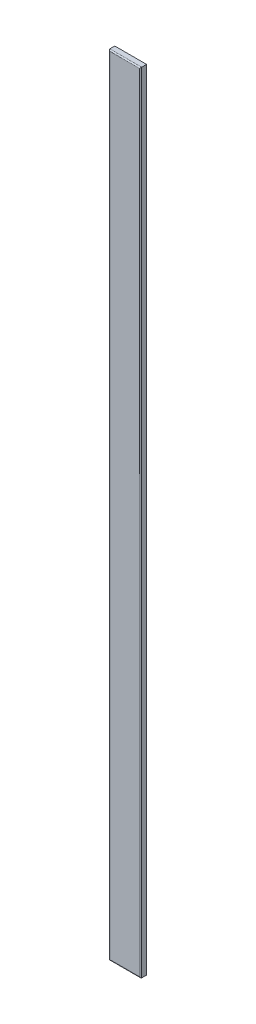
ISO-10303-21;
HEADER;
FILE_DESCRIPTION(('STEP AP214'),'2;1');
FILE_NAME('part.step','',(''),(''),'','','');
FILE_SCHEMA(('AUTOMOTIVE_DESIGN { 1 0 10303 214 1 1 1 1 }'));
ENDSEC;
DATA;
#1=APPLICATION_CONTEXT('core data for automotive mechanical design processes');
#2=APPLICATION_PROTOCOL_DEFINITION('international standard','automotive_design',2000,#1);
#3=PRODUCT_CONTEXT('',#1,'mechanical');
#4=PRODUCT('Part','Part','',(#3));
#5=PRODUCT_RELATED_PRODUCT_CATEGORY('part','',(#4));
#6=PRODUCT_DEFINITION_FORMATION('','',#4);
#7=PRODUCT_DEFINITION_CONTEXT('part definition',#1,'design');
#8=PRODUCT_DEFINITION('design','',#6,#7);
#9=PRODUCT_DEFINITION_SHAPE('','',#8);
#10=(LENGTH_UNIT() NAMED_UNIT(*) SI_UNIT(.MILLI.,.METRE.));
#11=(NAMED_UNIT(*) PLANE_ANGLE_UNIT() SI_UNIT($,.RADIAN.));
#12=(NAMED_UNIT(*) SI_UNIT($,.STERADIAN.) SOLID_ANGLE_UNIT());
#13=UNCERTAINTY_MEASURE_WITH_UNIT(LENGTH_MEASURE(1.E-05),#10,'distance_accuracy_value','');
#14=(GEOMETRIC_REPRESENTATION_CONTEXT(3) GLOBAL_UNCERTAINTY_ASSIGNED_CONTEXT((#13)) GLOBAL_UNIT_ASSIGNED_CONTEXT((#10,
#11,#12)) REPRESENTATION_CONTEXT('',''));
#15=CARTESIAN_POINT('',(0.,0.,0.));
#16=DIRECTION('',(0.,0.,1.));
#17=DIRECTION('',(1.,0.,0.));
#18=AXIS2_PLACEMENT_3D('',#15,#16,#17);
#19=CARTESIAN_POINT('',(-442.1,1089.8,16.));
#20=DIRECTION('',(-1.,0.,0.));
#21=DIRECTION('',(0.,-1.,0.));
#22=AXIS2_PLACEMENT_3D('',#19,#20,#21);
#23=PLANE('',#22);
#24=DIRECTION('',(0.,0.,-1.));
#25=VECTOR('',#24,1.);
#26=CARTESIAN_POINT('',(-442.1,1089.8,16.));
#27=LINE('',#26,#25);
#28=CARTESIAN_POINT('',(-442.1,1089.8,13.));
#29=VERTEX_POINT('',#28);
#30=CARTESIAN_POINT('',(-442.1,1089.8,0.));
#31=VERTEX_POINT('',#30);
#32=EDGE_CURVE('E95',#29,#31,#27,.T.);
#33=ORIENTED_EDGE('',*,*,#32,.F.);
#34=DIRECTION('',(0.,1.,0.));
#35=VECTOR('',#34,1.);
#36=CARTESIAN_POINT('',(-442.1,1089.8,13.));
#37=LINE('',#36,#35);
#38=CARTESIAN_POINT('',(-442.1,-1019.8,13.));
#39=VERTEX_POINT('',#38);
#40=EDGE_CURVE('E65',#29,#39,#37,.F.);
#41=ORIENTED_EDGE('',*,*,#40,.T.);
#42=DIRECTION('',(0.,0.,-1.));
#43=VECTOR('',#42,1.);
#44=CARTESIAN_POINT('',(-442.1,-1019.8,16.));
#45=LINE('',#44,#43);
#46=CARTESIAN_POINT('',(-442.1,-1019.8,0.));
#47=VERTEX_POINT('',#46);
#48=EDGE_CURVE('E115',#39,#47,#45,.T.);
#49=ORIENTED_EDGE('',*,*,#48,.T.);
#50=DIRECTION('',(0.,1.,0.));
#51=VECTOR('',#50,1.);
#52=CARTESIAN_POINT('',(-442.1,1089.8,0.));
#53=LINE('',#52,#51);
#54=EDGE_CURVE('E111',#47,#31,#53,.T.);
#55=ORIENTED_EDGE('',*,*,#54,.T.);
#56=EDGE_LOOP('',(#33,#41,#49,#55));
#57=FACE_BOUND('',#56,.T.);
#58=ADVANCED_FACE('F41',(#57),#23,.F.);
#59=CARTESIAN_POINT('',(-442.1,1089.8,16.));
#60=DIRECTION('',(0.,-1.,0.));
#61=DIRECTION('',(0.,0.,-1.));
#62=AXIS2_PLACEMENT_3D('',#59,#60,#61);
#63=PLANE('',#62);
#64=DIRECTION('',(0.,0.,-1.));
#65=VECTOR('',#64,1.);
#66=CARTESIAN_POINT('',(-527.1,1089.8,16.));
#67=LINE('',#66,#65);
#68=CARTESIAN_POINT('',(-527.1,1089.8,13.));
#69=VERTEX_POINT('',#68);
#70=CARTESIAN_POINT('',(-527.1,1089.8,0.));
#71=VERTEX_POINT('',#70);
#72=EDGE_CURVE('E105',#69,#71,#67,.T.);
#73=ORIENTED_EDGE('',*,*,#72,.F.);
#74=DIRECTION('',(-1.,0.,0.));
#75=VECTOR('',#74,1.);
#76=CARTESIAN_POINT('',(-442.1,1089.8,13.));
#77=LINE('',#76,#75);
#78=EDGE_CURVE('E102',#69,#29,#77,.F.);
#79=ORIENTED_EDGE('',*,*,#78,.T.);
#80=ORIENTED_EDGE('',*,*,#32,.T.);
#81=DIRECTION('',(-1.,0.,0.));
#82=VECTOR('',#81,1.);
#83=CARTESIAN_POINT('',(-442.1,1089.8,0.));
#84=LINE('',#83,#82);
#85=EDGE_CURVE('E99',#31,#71,#84,.T.);
#86=ORIENTED_EDGE('',*,*,#85,.T.);
#87=EDGE_LOOP('',(#73,#79,#80,#86));
#88=FACE_BOUND('',#87,.T.);
#89=ADVANCED_FACE('F98',(#88),#63,.F.);
#90=CARTESIAN_POINT('',(-527.1,1089.8,16.));
#91=DIRECTION('',(1.,0.,0.));
#92=DIRECTION('',(0.,0.,-1.));
#93=AXIS2_PLACEMENT_3D('',#90,#91,#92);
#94=PLANE('',#93);
#95=DIRECTION('',(0.,0.,-1.));
#96=VECTOR('',#95,1.);
#97=CARTESIAN_POINT('',(-527.1,-1019.8,16.));
#98=LINE('',#97,#96);
#99=CARTESIAN_POINT('',(-527.1,-1019.8,13.));
#100=VERTEX_POINT('',#99);
#101=CARTESIAN_POINT('',(-527.1,-1019.8,0.));
#102=VERTEX_POINT('',#101);
#103=EDGE_CURVE('E125',#100,#102,#98,.T.);
#104=ORIENTED_EDGE('',*,*,#103,.F.);
#105=DIRECTION('',(0.,-1.,0.));
#106=VECTOR('',#105,1.);
#107=CARTESIAN_POINT('',(-527.1,1089.8,13.));
#108=LINE('',#107,#106);
#109=EDGE_CURVE('E11',#100,#69,#108,.F.);
#110=ORIENTED_EDGE('',*,*,#109,.T.);
#111=ORIENTED_EDGE('',*,*,#72,.T.);
#112=DIRECTION('',(0.,-1.,0.));
#113=VECTOR('',#112,1.);
#114=CARTESIAN_POINT('',(-527.1,1089.8,0.));
#115=LINE('',#114,#113);
#116=EDGE_CURVE('E113',#71,#102,#115,.T.);
#117=ORIENTED_EDGE('',*,*,#116,.T.);
#118=EDGE_LOOP('',(#104,#110,#111,#117));
#119=FACE_BOUND('',#118,.T.);
#120=ADVANCED_FACE('F172',(#119),#94,.F.);
#121=CARTESIAN_POINT('',(-442.1,-1019.8,16.));
#122=DIRECTION('',(0.,1.,0.));
#123=DIRECTION('',(0.,0.,1.));
#124=AXIS2_PLACEMENT_3D('',#121,#122,#123);
#125=PLANE('',#124);
#126=ORIENTED_EDGE('',*,*,#48,.F.);
#127=DIRECTION('',(1.,0.,0.));
#128=VECTOR('',#127,1.);
#129=CARTESIAN_POINT('',(-442.1,-1019.8,13.));
#130=LINE('',#129,#128);
#131=EDGE_CURVE('E50',#39,#100,#130,.F.);
#132=ORIENTED_EDGE('',*,*,#131,.T.);
#133=ORIENTED_EDGE('',*,*,#103,.T.);
#134=DIRECTION('',(1.,0.,0.));
#135=VECTOR('',#134,1.);
#136=CARTESIAN_POINT('',(-442.1,-1019.8,0.));
#137=LINE('',#136,#135);
#138=EDGE_CURVE('E122',#102,#47,#137,.T.);
#139=ORIENTED_EDGE('',*,*,#138,.T.);
#140=EDGE_LOOP('',(#126,#132,#133,#139));
#141=FACE_BOUND('',#140,.T.);
#142=ADVANCED_FACE('F208',(#141),#125,.F.);
#143=CARTESIAN_POINT('',(0.,0.,16.));
#144=DIRECTION('',(0.,0.,-1.));
#145=DIRECTION('',(-1.,0.,0.));
#146=AXIS2_PLACEMENT_3D('',#143,#144,#145);
#147=PLANE('',#146);
#148=DIRECTION('',(0.,1.,0.));
#149=VECTOR('',#148,1.);
#150=CARTESIAN_POINT('',(-445.1,0.,16.));
#151=LINE('',#150,#149);
#152=CARTESIAN_POINT('',(-445.1,-1016.8,16.));
#153=VERTEX_POINT('',#152);
#154=CARTESIAN_POINT('',(-445.1,1086.8,16.));
#155=VERTEX_POINT('',#154);
#156=EDGE_CURVE('E131',#153,#155,#151,.T.);
#157=ORIENTED_EDGE('',*,*,#156,.T.);
#158=DIRECTION('',(-1.,0.,0.));
#159=VECTOR('',#158,1.);
#160=CARTESIAN_POINT('',(0.,1086.8,16.));
#161=LINE('',#160,#159);
#162=CARTESIAN_POINT('',(-524.1,1086.8,16.));
#163=VERTEX_POINT('',#162);
#164=EDGE_CURVE('E133',#155,#163,#161,.T.);
#165=ORIENTED_EDGE('',*,*,#164,.T.);
#166=DIRECTION('',(0.,-1.,0.));
#167=VECTOR('',#166,1.);
#168=CARTESIAN_POINT('',(-524.1,0.,16.));
#169=LINE('',#168,#167);
#170=CARTESIAN_POINT('',(-524.1,-1016.8,16.));
#171=VERTEX_POINT('',#170);
#172=EDGE_CURVE('E104',#163,#171,#169,.T.);
#173=ORIENTED_EDGE('',*,*,#172,.T.);
#174=DIRECTION('',(1.,0.,0.));
#175=VECTOR('',#174,1.);
#176=CARTESIAN_POINT('',(0.,-1016.8,16.));
#177=LINE('',#176,#175);
#178=EDGE_CURVE('E129',#171,#153,#177,.T.);
#179=ORIENTED_EDGE('',*,*,#178,.T.);
#180=EDGE_LOOP('',(#157,#165,#173,#179));
#181=FACE_BOUND('',#180,.T.);
#182=ADVANCED_FACE('F154',(#181),#147,.F.);
#183=CARTESIAN_POINT('',(0.,0.,0.));
#184=DIRECTION('',(0.,0.,-1.));
#185=DIRECTION('',(-1.,0.,0.));
#186=AXIS2_PLACEMENT_3D('',#183,#184,#185);
#187=PLANE('',#186);
#188=ORIENTED_EDGE('',*,*,#54,.F.);
#189=ORIENTED_EDGE('',*,*,#138,.F.);
#190=ORIENTED_EDGE('',*,*,#116,.F.);
#191=ORIENTED_EDGE('',*,*,#85,.F.);
#192=EDGE_LOOP('',(#188,#189,#190,#191));
#193=FACE_BOUND('',#192,.T.);
#194=ADVANCED_FACE('F109',(#193),#187,.T.);
#195=CARTESIAN_POINT('',(0.,-1016.8,13.));
#196=DIRECTION('',(1.,0.,0.));
#197=DIRECTION('',(0.,0.,-1.));
#198=AXIS2_PLACEMENT_3D('',#195,#196,#197);
#199=CYLINDRICAL_SURFACE('',#198,3.);
#200=CARTESIAN_POINT('',(-524.1,-1016.8,13.));
#201=DIRECTION('',(0.707106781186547,-0.707106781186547,0.));
#202=DIRECTION('',(-0.707106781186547,-0.707106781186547,0.));
#203=AXIS2_PLACEMENT_3D('',#200,#201,#202);
#204=ELLIPSE('',#203,4.24264068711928,3.);
#205=EDGE_CURVE('E119',#100,#171,#204,.F.);
#206=ORIENTED_EDGE('',*,*,#205,.F.);
#207=ORIENTED_EDGE('',*,*,#131,.F.);
#208=CARTESIAN_POINT('',(-445.1,-1016.8,13.));
#209=DIRECTION('',(0.707106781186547,0.707106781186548,0.));
#210=DIRECTION('',(0.707106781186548,-0.707106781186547,0.));
#211=AXIS2_PLACEMENT_3D('',#208,#209,#210);
#212=ELLIPSE('',#211,4.24264068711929,3.);
#213=EDGE_CURVE('E45',#153,#39,#212,.T.);
#214=ORIENTED_EDGE('',*,*,#213,.F.);
#215=ORIENTED_EDGE('',*,*,#178,.F.);
#216=EDGE_LOOP('',(#206,#207,#214,#215));
#217=FACE_BOUND('',#216,.T.);
#218=ADVANCED_FACE('F43',(#217),#199,.T.);
#219=CARTESIAN_POINT('',(-445.1,0.,13.));
#220=DIRECTION('',(0.,1.,0.));
#221=DIRECTION('',(-1.,0.,0.));
#222=AXIS2_PLACEMENT_3D('',#219,#220,#221);
#223=CYLINDRICAL_SURFACE('',#222,3.);
#224=ORIENTED_EDGE('',*,*,#213,.T.);
#225=ORIENTED_EDGE('',*,*,#40,.F.);
#226=CARTESIAN_POINT('',(-445.1,1086.8,13.));
#227=DIRECTION('',(-0.707106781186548,0.707106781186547,0.));
#228=DIRECTION('',(0.707106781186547,0.707106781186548,0.));
#229=AXIS2_PLACEMENT_3D('',#226,#227,#228);
#230=ELLIPSE('',#229,4.24264068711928,3.);
#231=EDGE_CURVE('E141',#155,#29,#230,.T.);
#232=ORIENTED_EDGE('',*,*,#231,.F.);
#233=ORIENTED_EDGE('',*,*,#156,.F.);
#234=EDGE_LOOP('',(#224,#225,#232,#233));
#235=FACE_BOUND('',#234,.T.);
#236=ADVANCED_FACE('F160',(#235),#223,.T.);
#237=CARTESIAN_POINT('',(-524.1,0.,13.));
#238=DIRECTION('',(0.,-1.,0.));
#239=DIRECTION('',(0.,0.,-1.));
#240=AXIS2_PLACEMENT_3D('',#237,#238,#239);
#241=CYLINDRICAL_SURFACE('',#240,3.);
#242=ORIENTED_EDGE('',*,*,#205,.T.);
#243=ORIENTED_EDGE('',*,*,#172,.F.);
#244=CARTESIAN_POINT('',(-524.1,1086.8,13.));
#245=DIRECTION('',(-0.707106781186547,-0.707106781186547,0.));
#246=DIRECTION('',(0.707106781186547,-0.707106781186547,0.));
#247=AXIS2_PLACEMENT_3D('',#244,#245,#246);
#248=ELLIPSE('',#247,4.24264068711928,3.);
#249=EDGE_CURVE('E139',#69,#163,#248,.F.);
#250=ORIENTED_EDGE('',*,*,#249,.F.);
#251=ORIENTED_EDGE('',*,*,#109,.F.);
#252=EDGE_LOOP('',(#242,#243,#250,#251));
#253=FACE_BOUND('',#252,.T.);
#254=ADVANCED_FACE('F147',(#253),#241,.T.);
#255=CARTESIAN_POINT('',(0.,1086.8,13.));
#256=DIRECTION('',(-1.,0.,0.));
#257=DIRECTION('',(0.,0.,1.));
#258=AXIS2_PLACEMENT_3D('',#255,#256,#257);
#259=CYLINDRICAL_SURFACE('',#258,3.);
#260=ORIENTED_EDGE('',*,*,#231,.T.);
#261=ORIENTED_EDGE('',*,*,#78,.F.);
#262=ORIENTED_EDGE('',*,*,#249,.T.);
#263=ORIENTED_EDGE('',*,*,#164,.F.);
#264=EDGE_LOOP('',(#260,#261,#262,#263));
#265=FACE_BOUND('',#264,.T.);
#266=ADVANCED_FACE('F158',(#265),#259,.T.);
#267=CLOSED_SHELL('',(#58,#89,#120,#142,#182,#194,#218,#236,#254,#266));
#268=MANIFOLD_SOLID_BREP('B2',#267);
#269=ADVANCED_BREP_SHAPE_REPRESENTATION('',(#18,#268),#14);
#270=SHAPE_DEFINITION_REPRESENTATION(#9,#269);
ENDSEC;
END-ISO-10303-21;
